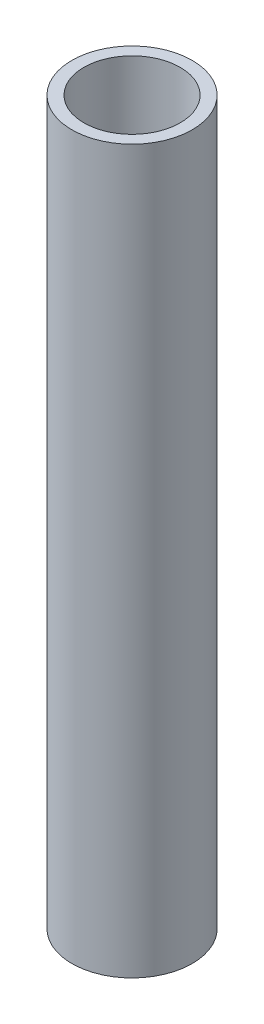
from build123d import *

# Parameters (mm, degrees)
SKETCH1_R           = 12.7
SKETCH1_R_2         = 10.16
BOSS_EXTRUDE1_DEPTH = 152.4


with BuildPart() as part:
    # Sketch1 → Boss-Extrude1 (new body)
    with BuildSketch(Plane(origin=(0, 0, 0), x_dir=(1, 0, 0), z_dir=(0, 1, 0))):
        with Locations(Location((0, 0, 0), (0, 0, 90))):
            Circle(SKETCH1_R)
        with Locations(Location((0, 0, 0), (0, 0, 90))):
            Circle(SKETCH1_R_2, mode=Mode.SUBTRACT)
    extrude(amount=BOSS_EXTRUDE1_DEPTH)


solid = part.part
